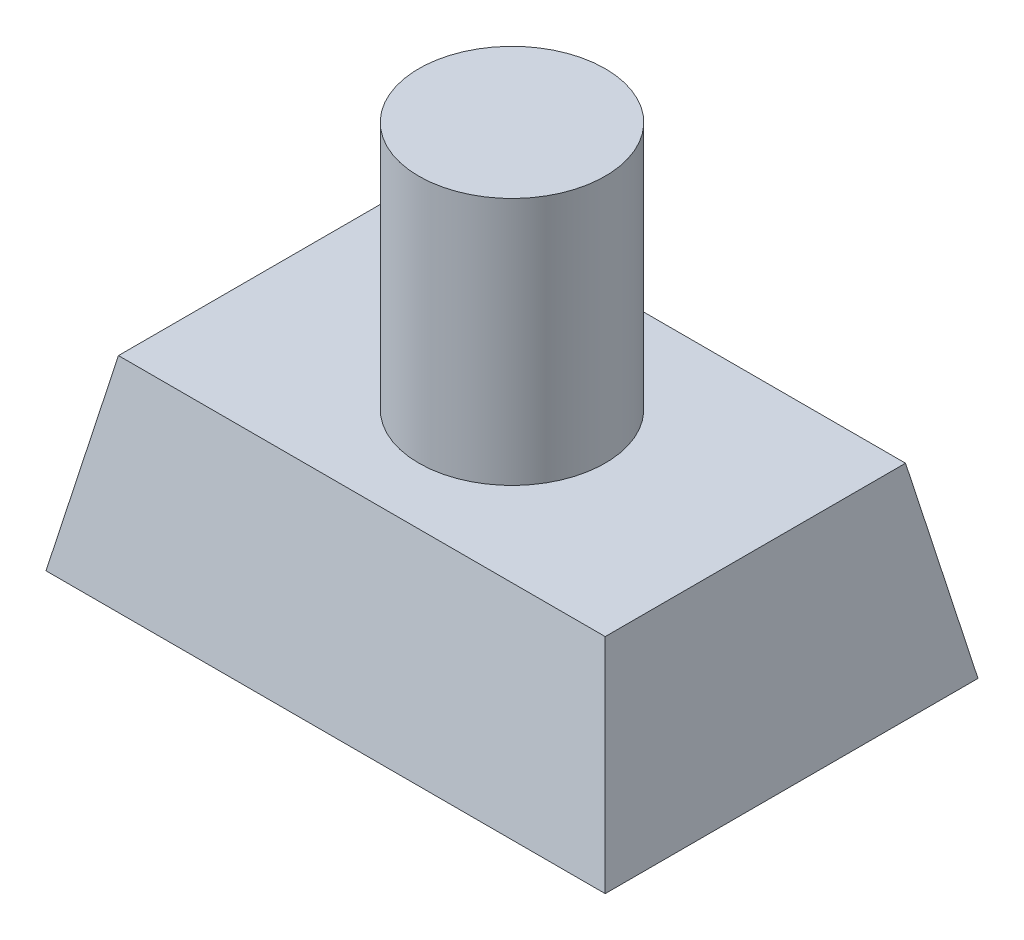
ISO-10303-21;
HEADER;
FILE_DESCRIPTION(('STEP AP214'),'2;1');
FILE_NAME('part.step','',(''),(''),'','','');
FILE_SCHEMA(('AUTOMOTIVE_DESIGN { 1 0 10303 214 1 1 1 1 }'));
ENDSEC;
DATA;
#1=APPLICATION_CONTEXT('core data for automotive mechanical design processes');
#2=APPLICATION_PROTOCOL_DEFINITION('international standard','automotive_design',2000,#1);
#3=PRODUCT_CONTEXT('',#1,'mechanical');
#4=PRODUCT('Part','Part','',(#3));
#5=PRODUCT_RELATED_PRODUCT_CATEGORY('part','',(#4));
#6=PRODUCT_DEFINITION_FORMATION('','',#4);
#7=PRODUCT_DEFINITION_CONTEXT('part definition',#1,'design');
#8=PRODUCT_DEFINITION('design','',#6,#7);
#9=PRODUCT_DEFINITION_SHAPE('','',#8);
#10=(LENGTH_UNIT() NAMED_UNIT(*) SI_UNIT(.MILLI.,.METRE.));
#11=(NAMED_UNIT(*) PLANE_ANGLE_UNIT() SI_UNIT($,.RADIAN.));
#12=(NAMED_UNIT(*) SI_UNIT($,.STERADIAN.) SOLID_ANGLE_UNIT());
#13=UNCERTAINTY_MEASURE_WITH_UNIT(LENGTH_MEASURE(1.E-05),#10,'distance_accuracy_value','');
#14=(GEOMETRIC_REPRESENTATION_CONTEXT(3) GLOBAL_UNCERTAINTY_ASSIGNED_CONTEXT((#13)) GLOBAL_UNIT_ASSIGNED_CONTEXT((#10,
#11,#12)) REPRESENTATION_CONTEXT('',''));
#15=CARTESIAN_POINT('',(0.,0.,0.));
#16=DIRECTION('',(0.,0.,1.));
#17=DIRECTION('',(1.,0.,0.));
#18=AXIS2_PLACEMENT_3D('',#15,#16,#17);
#19=CARTESIAN_POINT('',(0.,30.,-60.));
#20=DIRECTION('',(0.,-1.,0.));
#21=DIRECTION('',(0.,0.,-1.));
#22=AXIS2_PLACEMENT_3D('',#19,#20,#21);
#23=PLANE('',#22);
#24=DIRECTION('',(0.,0.,-1.));
#25=VECTOR('',#24,1.);
#26=CARTESIAN_POINT('',(5.83140927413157,30.,-60.));
#27=LINE('',#26,#25);
#28=CARTESIAN_POINT('',(5.83140927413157,30.,-54.1685907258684));
#29=VERTEX_POINT('',#28);
#30=CARTESIAN_POINT('',(5.83140927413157,30.,-5.83140927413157));
#31=VERTEX_POINT('',#30);
#32=EDGE_CURVE('E101',#29,#31,#27,.F.);
#33=ORIENTED_EDGE('',*,*,#32,.T.);
#34=DIRECTION('',(-1.,0.,0.));
#35=VECTOR('',#34,1.);
#36=CARTESIAN_POINT('',(0.,30.,-5.83140927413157));
#37=LINE('',#36,#35);
#38=CARTESIAN_POINT('',(84.1685907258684,30.,-5.83140927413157));
#39=VERTEX_POINT('',#38);
#40=EDGE_CURVE('E86',#31,#39,#37,.F.);
#41=ORIENTED_EDGE('',*,*,#40,.T.);
#42=DIRECTION('',(0.,0.,1.));
#43=VECTOR('',#42,1.);
#44=CARTESIAN_POINT('',(84.1685907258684,30.,-60.));
#45=LINE('',#44,#43);
#46=CARTESIAN_POINT('',(84.1685907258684,30.,-54.1685907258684));
#47=VERTEX_POINT('',#46);
#48=EDGE_CURVE('E53',#39,#47,#45,.F.);
#49=ORIENTED_EDGE('',*,*,#48,.T.);
#50=DIRECTION('',(1.,0.,0.));
#51=VECTOR('',#50,1.);
#52=CARTESIAN_POINT('',(0.,30.,-54.1685907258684));
#53=LINE('',#52,#51);
#54=EDGE_CURVE('E48',#47,#29,#53,.F.);
#55=ORIENTED_EDGE('',*,*,#54,.T.);
#56=EDGE_LOOP('',(#33,#41,#49,#55));
#57=FACE_BOUND('',#56,.T.);
#58=CARTESIAN_POINT('',(45.,30.,-30.));
#59=DIRECTION('',(0.,-1.,0.));
#60=DIRECTION('',(0.,0.,-1.));
#61=AXIS2_PLACEMENT_3D('',#58,#59,#60);
#62=CIRCLE('',#61,15.);
#63=CARTESIAN_POINT('',(45.,30.,-45.));
#64=VERTEX_POINT('',#63);
#65=EDGE_CURVE('E11',#64,#64,#62,.F.);
#66=ORIENTED_EDGE('',*,*,#65,.F.);
#67=EDGE_LOOP('',(#66));
#68=FACE_BOUND('',#67,.T.);
#69=ADVANCED_FACE('F33',(#57,#68),#23,.F.);
#70=CARTESIAN_POINT('',(0.,0.,0.));
#71=DIRECTION('',(-0.981627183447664,0.190808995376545,0.));
#72=DIRECTION('',(-0.190808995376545,-0.981627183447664,0.));
#73=AXIS2_PLACEMENT_3D('',#70,#71,#72);
#74=PLANE('',#73);
#75=DIRECTION('',(0.,0.,1.));
#76=VECTOR('',#75,1.);
#77=CARTESIAN_POINT('',(0.,0.,0.));
#78=LINE('',#77,#76);
#79=CARTESIAN_POINT('',(0.,0.,-60.));
#80=VERTEX_POINT('',#79);
#81=CARTESIAN_POINT('',(0.,0.,0.));
#82=VERTEX_POINT('',#81);
#83=EDGE_CURVE('E79',#80,#82,#78,.T.);
#84=ORIENTED_EDGE('',*,*,#83,.T.);
#85=DIRECTION('',(-0.187427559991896,-0.964231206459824,0.187427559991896));
#86=VECTOR('',#85,1.);
#87=CARTESIAN_POINT('',(0.,0.,0.));
#88=LINE('',#87,#86);
#89=EDGE_CURVE('E41',#31,#82,#88,.T.);
#90=ORIENTED_EDGE('',*,*,#89,.F.);
#91=ORIENTED_EDGE('',*,*,#32,.F.);
#92=DIRECTION('',(-0.187427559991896,-0.964231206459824,-0.187427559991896));
#93=VECTOR('',#92,1.);
#94=CARTESIAN_POINT('',(2.10774541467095,10.8434101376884,-57.892254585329));
#95=LINE('',#94,#93);
#96=EDGE_CURVE('E93',#29,#80,#95,.T.);
#97=ORIENTED_EDGE('',*,*,#96,.T.);
#98=EDGE_LOOP('',(#84,#90,#91,#97));
#99=FACE_BOUND('',#98,.T.);
#100=ADVANCED_FACE('F92',(#99),#74,.T.);
#101=CARTESIAN_POINT('',(0.,0.,0.));
#102=DIRECTION('',(0.,0.190808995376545,0.981627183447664));
#103=DIRECTION('',(0.,-0.981627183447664,0.190808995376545));
#104=AXIS2_PLACEMENT_3D('',#101,#102,#103);
#105=PLANE('',#104);
#106=DIRECTION('',(1.,0.,0.));
#107=VECTOR('',#106,1.);
#108=CARTESIAN_POINT('',(0.,0.,0.));
#109=LINE('',#108,#107);
#110=CARTESIAN_POINT('',(90.,0.,0.));
#111=VERTEX_POINT('',#110);
#112=EDGE_CURVE('E74',#82,#111,#109,.T.);
#113=ORIENTED_EDGE('',*,*,#112,.T.);
#114=DIRECTION('',(0.187427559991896,-0.964231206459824,0.187427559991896));
#115=VECTOR('',#114,1.);
#116=CARTESIAN_POINT('',(90.,0.,0.));
#117=LINE('',#116,#115);
#118=EDGE_CURVE('E89',#39,#111,#117,.T.);
#119=ORIENTED_EDGE('',*,*,#118,.F.);
#120=ORIENTED_EDGE('',*,*,#40,.F.);
#121=ORIENTED_EDGE('',*,*,#89,.T.);
#122=EDGE_LOOP('',(#113,#119,#120,#121));
#123=FACE_BOUND('',#122,.T.);
#124=ADVANCED_FACE('F35',(#123),#105,.T.);
#125=CARTESIAN_POINT('',(90.,0.,0.));
#126=DIRECTION('',(0.981627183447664,0.190808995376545,0.));
#127=DIRECTION('',(-0.190808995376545,0.981627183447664,0.));
#128=AXIS2_PLACEMENT_3D('',#125,#126,#127);
#129=PLANE('',#128);
#130=DIRECTION('',(0.,0.,-1.));
#131=VECTOR('',#130,1.);
#132=CARTESIAN_POINT('',(90.,0.,0.));
#133=LINE('',#132,#131);
#134=CARTESIAN_POINT('',(90.,0.,-60.));
#135=VERTEX_POINT('',#134);
#136=EDGE_CURVE('E80',#111,#135,#133,.T.);
#137=ORIENTED_EDGE('',*,*,#136,.T.);
#138=DIRECTION('',(0.187427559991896,-0.964231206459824,-0.187427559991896));
#139=VECTOR('',#138,1.);
#140=CARTESIAN_POINT('',(86.8383818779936,16.2651152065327,-56.8383818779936));
#141=LINE('',#140,#139);
#142=EDGE_CURVE('E104',#47,#135,#141,.T.);
#143=ORIENTED_EDGE('',*,*,#142,.F.);
#144=ORIENTED_EDGE('',*,*,#48,.F.);
#145=ORIENTED_EDGE('',*,*,#118,.T.);
#146=EDGE_LOOP('',(#137,#143,#144,#145));
#147=FACE_BOUND('',#146,.T.);
#148=ADVANCED_FACE('F112',(#147),#129,.T.);
#149=CARTESIAN_POINT('',(0.,0.,-60.));
#150=DIRECTION('',(0.,0.190808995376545,-0.981627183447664));
#151=DIRECTION('',(0.,0.981627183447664,0.190808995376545));
#152=AXIS2_PLACEMENT_3D('',#149,#150,#151);
#153=PLANE('',#152);
#154=DIRECTION('',(-1.,0.,0.));
#155=VECTOR('',#154,1.);
#156=CARTESIAN_POINT('',(0.,0.,-60.));
#157=LINE('',#156,#155);
#158=EDGE_CURVE('E100',#135,#80,#157,.T.);
#159=ORIENTED_EDGE('',*,*,#158,.T.);
#160=ORIENTED_EDGE('',*,*,#96,.F.);
#161=ORIENTED_EDGE('',*,*,#54,.F.);
#162=ORIENTED_EDGE('',*,*,#142,.T.);
#163=EDGE_LOOP('',(#159,#160,#161,#162));
#164=FACE_BOUND('',#163,.T.);
#165=ADVANCED_FACE('F114',(#164),#153,.T.);
#166=CARTESIAN_POINT('',(0.,0.,-60.));
#167=DIRECTION('',(0.,-1.,0.));
#168=DIRECTION('',(0.,0.,-1.));
#169=AXIS2_PLACEMENT_3D('',#166,#167,#168);
#170=PLANE('',#169);
#171=ORIENTED_EDGE('',*,*,#83,.F.);
#172=ORIENTED_EDGE('',*,*,#158,.F.);
#173=ORIENTED_EDGE('',*,*,#136,.F.);
#174=ORIENTED_EDGE('',*,*,#112,.F.);
#175=EDGE_LOOP('',(#171,#172,#173,#174));
#176=FACE_BOUND('',#175,.T.);
#177=ADVANCED_FACE('F76',(#176),#170,.T.);
#178=CARTESIAN_POINT('',(45.,70.,-30.));
#179=DIRECTION('',(0.,-1.,0.));
#180=DIRECTION('',(0.,0.,-1.));
#181=AXIS2_PLACEMENT_3D('',#178,#179,#180);
#182=CYLINDRICAL_SURFACE('',#181,15.);
#183=CARTESIAN_POINT('',(45.,70.,-30.));
#184=DIRECTION('',(0.,1.,0.));
#185=DIRECTION('',(0.,0.,1.));
#186=AXIS2_PLACEMENT_3D('',#183,#184,#185);
#187=CIRCLE('',#186,15.);
#188=CARTESIAN_POINT('',(45.,70.,-15.));
#189=VERTEX_POINT('',#188);
#190=EDGE_CURVE('E94',#189,#189,#187,.T.);
#191=ORIENTED_EDGE('',*,*,#190,.F.);
#192=EDGE_LOOP('',(#191));
#193=FACE_BOUND('',#192,.T.);
#194=ORIENTED_EDGE('',*,*,#65,.T.);
#195=EDGE_LOOP('',(#194));
#196=FACE_BOUND('',#195,.T.);
#197=ADVANCED_FACE('F121',(#193,#196),#182,.T.);
#198=CARTESIAN_POINT('',(45.,70.,-30.));
#199=DIRECTION('',(0.,1.,0.));
#200=DIRECTION('',(0.,0.,1.));
#201=AXIS2_PLACEMENT_3D('',#198,#199,#200);
#202=PLANE('',#201);
#203=ORIENTED_EDGE('',*,*,#190,.T.);
#204=EDGE_LOOP('',(#203));
#205=FACE_BOUND('',#204,.T.);
#206=ADVANCED_FACE('F132',(#205),#202,.T.);
#207=CLOSED_SHELL('',(#69,#100,#124,#148,#165,#177,#197,#206));
#208=MANIFOLD_SOLID_BREP('B2',#207);
#209=ADVANCED_BREP_SHAPE_REPRESENTATION('',(#18,#208),#14);
#210=SHAPE_DEFINITION_REPRESENTATION(#9,#209);
ENDSEC;
END-ISO-10303-21;
